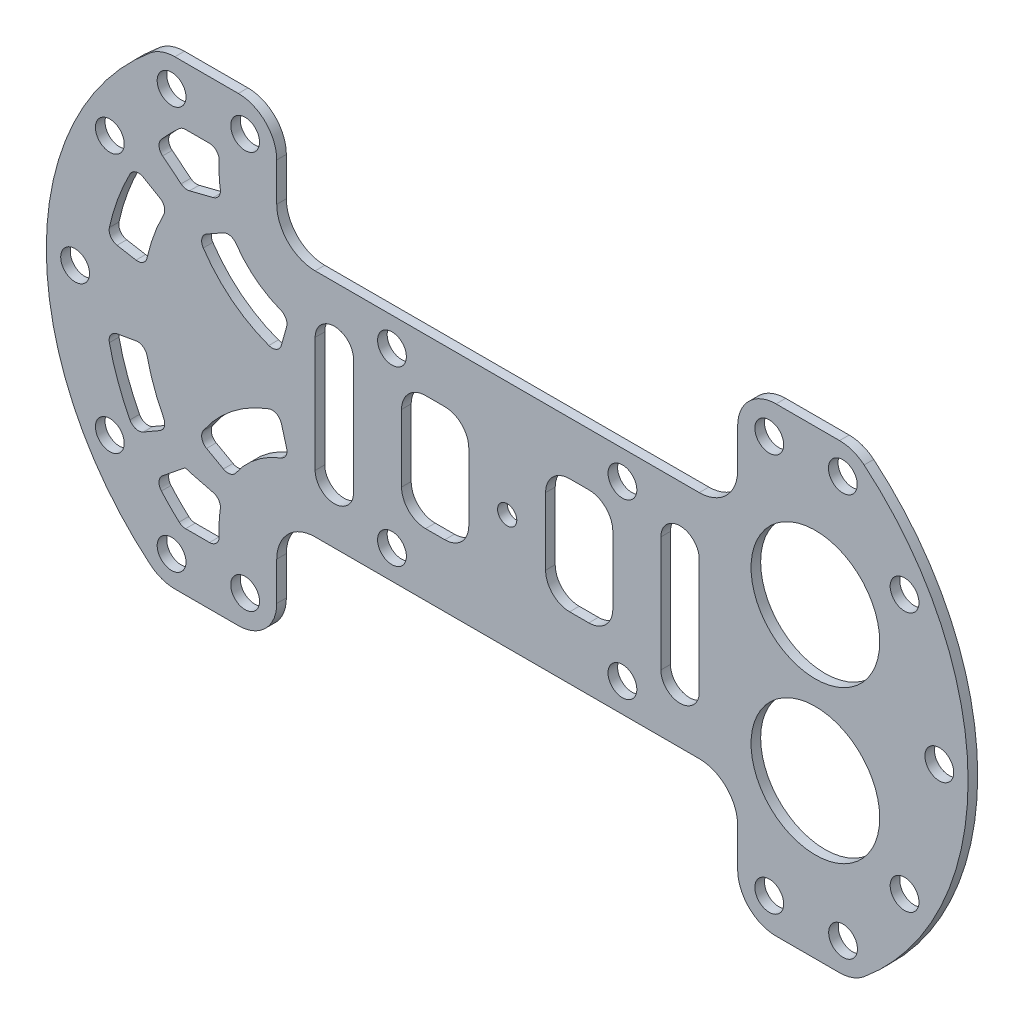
from build123d import *

# Parameters (mm, degrees)
BOSS_EXTRUDE1_DEPTH = 3.175
SKETCH2_R           = 4.7625
CUT_EXTRUDE1_DEPTH  = 12.7
SKETCH3_R           = 21.2725
CUT_EXTRUDE2_DEPTH  = 12.7
SKETCH4_R           = 3.175
CUT_EXTRUDE3_DEPTH  = 256.169224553


with BuildPart() as part:
    # Sketch1 → Boss-Extrude1 (new body)
    with BuildSketch(Plane.XY):
        with BuildLine():
            Line((151.915677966, 88.9), (151.915677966, 101.6))
            ThreePointArc((151.915677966, 101.6), (155.635421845, 110.580256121), (164.615677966, 114.3))
            Line((164.615677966, 114.3), (185.612739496, 114.3))
            ThreePointArc((185.612739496, 114.3), (189.926714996, 113.544857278), (193.727672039, 111.369230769))
            ThreePointArc((193.727672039, 111.369230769), (228.115677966, 38.1), (193.727672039, -35.169230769))
            ThreePointArc((193.727672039, -35.169230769), (189.926714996, -37.344857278), (185.612739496, -38.1))
            Line((185.612739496, -38.1), (164.615677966, -38.1))
            ThreePointArc((164.615677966, -38.1), (155.635421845, -34.380256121), (151.915677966, -25.4))
            Line((151.915677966, -25.4), (151.915677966, -12.7))
            ThreePointArc((151.915677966, -12.7), (148.195934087, -3.719743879), (139.215677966, 0))
            Line((139.215677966, 0), (12.215677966, 0))
            ThreePointArc((12.215677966, 0), (3.235421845, -3.719743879), (-0.484322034, -12.7))
            Line((-0.484322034, -12.7), (-0.484322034, -25.4))
            ThreePointArc((-0.484322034, -25.4), (-4.204065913, -34.380256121), (-13.184322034, -38.1))
            Line((-13.184322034, -38.1), (-34.181383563, -38.1))
            ThreePointArc((-34.181383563, -38.1), (-38.495359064, -37.344857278), (-42.296316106, -35.169230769))
            ThreePointArc((-42.296316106, -35.169230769), (-76.684322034, 38.1), (-42.296316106, 111.369230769))
            ThreePointArc((-42.296316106, 111.369230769), (-38.495359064, 113.544857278), (-34.181383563, 114.3))
            Line((-34.181383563, 114.3), (-13.184322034, 114.3))
            ThreePointArc((-13.184322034, 114.3), (-4.204065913, 110.580256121), (-0.484322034, 101.6))
            Line((-0.484322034, 101.6), (-0.484322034, 88.9))
            ThreePointArc((-0.484322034, 88.9), (3.235421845, 79.919743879), (12.215677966, 76.2))
            Line((12.215677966, 76.2), (139.215677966, 76.2))
            ThreePointArc((139.215677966, 76.2), (148.195934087, 79.919743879), (151.915677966, 88.9))
        make_face()
    extrude(amount=BOSS_EXTRUDE1_DEPTH)

    # Sketch2 → Cut-Extrude1 (cut)
    with BuildSketch(Plane.XY.offset(3.175)):
        with Locations((207.105705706, 80.9625)):
            Circle(SKETCH2_R)
        with Locations((218.590677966, 38.1)):
            Circle(SKETCH2_R)
        with Locations((207.105705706, -4.7625)):
            Circle(SKETCH2_R)
        with Locations((113.815677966, 9.525)):
            Circle(SKETCH2_R)
        with Locations((37.615677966, 9.525)):
            Circle(SKETCH2_R)
        with Locations(Location((37.615677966, 66.675, 0), (0, 0, 180))):
            Circle(SKETCH2_R)
        with Locations(Location((113.815677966, 66.675, 0), (0, 0, 180))):
            Circle(SKETCH2_R)
        with Locations(Location((-55.674349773, 80.9625, 0), (0, 0, 180))):
            Circle(SKETCH2_R)
        with Locations(Location((-67.159322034, 38.1, 0), (0, 0, 180))):
            Circle(SKETCH2_R)
        with Locations(Location((-55.674349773, -4.7625, 0), (0, 0, 180))):
            Circle(SKETCH2_R)
        with Locations((-10.939258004, 103.84506403)):
            Circle(SKETCH2_R)
        with Locations((-35.259877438, 104.586214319)):
            Circle(SKETCH2_R)
        with Locations((-10.939258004, -27.64506403)):
            Circle(SKETCH2_R)
        with Locations((-35.259877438, -28.575)):
            Circle(SKETCH2_R)
        with Locations((162.370613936, -27.64506403)):
            Circle(SKETCH2_R)
        with Locations((186.766328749, -28.358015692)):
            Circle(SKETCH2_R)
        with Locations((162.370613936, 103.84506403)):
            Circle(SKETCH2_R)
        with Locations((186.691233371, 104.586214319)):
            Circle(SKETCH2_R)
    extrude(amount=-CUT_EXTRUDE1_DEPTH, mode=Mode.SUBTRACT)

    # Sketch3 → Cut-Extrude2 (cut)
    with BuildSketch(Plane.XY.offset(3.175)):
        with Locations((177.618359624, 12.895127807)):
            Circle(SKETCH3_R)
        with Locations((177.618359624, 63.304872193)):
            Circle(SKETCH3_R)
        with BuildLine():
            Line((-32.102437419, 78.954923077), (-38.227719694, 83.89388586))
            ThreePointArc((-38.227719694, 83.89388586), (-39.398315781, 86.095739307), (-38.617425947, 88.464001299))
            ThreePointArc((-38.617425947, 88.464001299), (-35.770315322, 91.523214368), (-32.7597709, 94.42173913))
            ThreePointArc((-32.7597709, 94.42173913), (-31.767885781, 95.035702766), (-30.621210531, 95.25))
            Line((-30.621210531, 95.25), (-22.709322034, 95.25))
            ThreePointArc((-22.709322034, 95.25), (-20.464258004, 94.32006403), (-19.534322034, 92.075))
            Line((-19.534322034, 92.075), (-19.534322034, 88.9))
            ThreePointArc((-19.534322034, 88.9), (-19.435704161, 86.399498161), (-19.140463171, 83.914529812))
            ThreePointArc((-19.140463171, 83.914529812), (-19.624152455, 81.670153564), (-21.494538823, 80.338675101))
            Line((-21.494538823, 80.338675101), (-29.32797588, 78.349230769))
            ThreePointArc((-29.32797588, 78.349230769), (-30.786698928, 78.324596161), (-32.102437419, 78.954923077))
        make_face()
        with BuildLine():
            Line((-18.130057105, 71.905549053), (-23.689879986, 68.791894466))
            ThreePointArc((-23.689879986, 68.791894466), (-25.225209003, 66.765285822), (-24.781135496, 64.261852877))
            ThreePointArc((-24.781135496, 64.261852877), (-15.30302816, 53.992646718), (-3.104932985, 47.173732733))
            ThreePointArc((-3.104932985, 47.173732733), (-0.567003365, 47.326346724), (1.045192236, 49.29235871))
            Line((1.045192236, 49.29235871), (2.774894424, 55.425433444))
            ThreePointArc((2.774894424, 55.425433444), (2.556993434, 57.710974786), (0.85515123, 59.252050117))
            ThreePointArc((0.85515123, 59.252050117), (-7.440540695, 63.966176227), (-13.961013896, 70.932159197))
            ThreePointArc((-13.961013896, 70.932159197), (-15.856797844, 72.22722031), (-18.130057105, 71.905549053))
        make_face()
        with BuildLine():
            Line((-39.111061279, 71.399680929), (-44.61602429, 74.577972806))
            ThreePointArc((-44.61602429, 74.577972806), (-47.091766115, 74.876563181), (-49.019576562, 73.294791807))
            ThreePointArc((-49.019576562, 73.294791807), (-53.038899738, 64.161934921), (-55.830406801, 54.582189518))
            ThreePointArc((-55.830406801, 54.582189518), (-55.370361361, 52.131309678), (-53.2819029, 50.768667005))
            Line((-53.2819029, 50.768667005), (-47.021889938, 49.664857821))
            ThreePointArc((-47.021889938, 49.664857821), (-44.711909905, 50.14818046), (-43.373593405, 52.092021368))
            ThreePointArc((-43.373593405, 52.092021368), (-41.104803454, 59.818279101), (-37.876454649, 67.195285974))
            ThreePointArc((-37.876454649, 67.195285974), (-37.652187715, 69.544607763), (-39.111061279, 71.399680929))
        make_face()
        with BuildLine():
            Line((2.774894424, 20.774566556), (1.045192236, 26.90764129))
            ThreePointArc((1.045192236, 26.90764129), (-0.567003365, 28.873653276), (-3.104932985, 29.026267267))
            ThreePointArc((-3.104932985, 29.026267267), (-15.30302816, 22.207353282), (-24.781135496, 11.938147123))
            ThreePointArc((-24.781135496, 11.938147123), (-25.225209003, 9.434714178), (-23.689879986, 7.408105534))
            Line((-23.689879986, 7.408105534), (-18.130057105, 4.294450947))
            ThreePointArc((-18.130057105, 4.294450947), (-15.856797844, 3.97277969), (-13.961013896, 5.267840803))
            ThreePointArc((-13.961013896, 5.267840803), (-7.440540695, 12.233823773), (0.85515123, 16.947949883))
            ThreePointArc((0.85515123, 16.947949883), (2.556993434, 18.489025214), (2.774894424, 20.774566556))
        make_face()
        with BuildLine():
            Line((-22.709322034, -19.05), (-30.621210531, -19.05))
            ThreePointArc((-30.621210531, -19.05), (-31.767885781, -18.835702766), (-32.7597709, -18.22173913))
            ThreePointArc((-32.7597709, -18.22173913), (-35.770315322, -15.323214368), (-38.617425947, -12.264001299))
            ThreePointArc((-38.617425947, -12.264001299), (-39.398315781, -9.895739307), (-38.227719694, -7.69388586))
            Line((-38.227719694, -7.69388586), (-30.866629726, -1.758461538))
            ThreePointArc((-30.866629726, -1.758461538), (-30.072485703, -1.856128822), (-29.32797588, -2.149230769))
            Line((-29.32797588, -2.149230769), (-21.494538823, -4.138675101))
            ThreePointArc((-21.494538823, -4.138675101), (-19.624152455, -5.470153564), (-19.140463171, -7.714529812))
            ThreePointArc((-19.140463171, -7.714529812), (-19.435704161, -10.199498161), (-19.534322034, -12.7))
            Line((-19.534322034, -12.7), (-19.534322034, -15.875))
            ThreePointArc((-19.534322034, -15.875), (-20.464258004, -18.12006403), (-22.709322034, -19.05))
        make_face()
        with BuildLine():
            Line((88.415677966, 50.8), (88.415677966, 28.575))
            ThreePointArc((88.415677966, 28.575), (90.74051789, 22.962339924), (96.353177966, 20.6375))
            Line((96.353177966, 20.6375), (102.703177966, 20.6375))
            ThreePointArc((102.703177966, 20.6375), (108.315838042, 22.962339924), (110.640677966, 28.575))
            Line((110.640677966, 28.575), (110.640677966, 50.8))
            ThreePointArc((110.640677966, 50.8), (108.315838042, 56.412660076), (102.703177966, 58.7375))
            Line((102.703177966, 58.7375), (96.353177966, 58.7375))
            ThreePointArc((96.353177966, 58.7375), (90.74051789, 56.412660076), (88.415677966, 50.8))
        make_face()
        with BuildLine():
            Line((48.728177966, 58.7375), (55.078177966, 58.7375))
            ThreePointArc((55.078177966, 58.7375), (60.690838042, 56.412660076), (63.015677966, 50.8))
            Line((63.015677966, 50.8), (63.015677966, 28.575))
            ThreePointArc((63.015677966, 28.575), (60.690838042, 22.962339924), (55.078177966, 20.6375))
            Line((55.078177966, 20.6375), (48.728177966, 20.6375))
            ThreePointArc((48.728177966, 20.6375), (43.11551789, 22.962339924), (40.790677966, 28.575))
            Line((40.790677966, 28.575), (40.790677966, 50.8))
            ThreePointArc((40.790677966, 50.8), (43.11551789, 56.412660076), (48.728177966, 58.7375))
        make_face()
        with BuildLine():
            Line((-47.021889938, 26.535142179), (-53.2819029, 25.431332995))
            ThreePointArc((-53.2819029, 25.431332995), (-55.370361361, 24.068690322), (-55.830406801, 21.617810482))
            ThreePointArc((-55.830406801, 21.617810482), (-53.038899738, 12.038065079), (-49.019576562, 2.905208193))
            ThreePointArc((-49.019576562, 2.905208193), (-47.091766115, 1.323436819), (-44.61602429, 1.622027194))
            Line((-44.61602429, 1.622027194), (-39.111061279, 4.800319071))
            ThreePointArc((-39.111061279, 4.800319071), (-37.652187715, 6.655392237), (-37.876454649, 9.004714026))
            ThreePointArc((-37.876454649, 9.004714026), (-41.104803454, 16.381720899), (-43.373593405, 24.107978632))
            ThreePointArc((-43.373593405, 24.107978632), (-44.711909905, 26.05181954), (-47.021889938, 26.535142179))
        make_face()
        with BuildLine():
            Line((139.215677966, 57.15), (139.215677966, 19.05))
            ThreePointArc((139.215677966, 19.05), (132.865677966, 12.7), (126.515677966, 19.05))
            Line((126.515677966, 19.05), (126.515677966, 57.15))
            ThreePointArc((126.515677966, 57.15), (132.865677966, 63.5), (139.215677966, 57.15))
        make_face()
        with BuildLine():
            Line((24.915677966, 57.15), (24.915677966, 19.05))
            ThreePointArc((24.915677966, 19.05), (18.565677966, 12.7), (12.215677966, 19.05))
            Line((12.215677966, 19.05), (12.215677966, 57.15))
            ThreePointArc((12.215677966, 57.15), (18.565677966, 63.5), (24.915677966, 57.15))
        make_face()
    extrude(amount=-CUT_EXTRUDE2_DEPTH, mode=Mode.SUBTRACT)

    # Sketch4 → Cut-Extrude3 (cut, through all)
    with BuildSketch(Plane.XY.offset(3.175)):
        with Locations((75.715677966, 38.1)):
            Circle(SKETCH4_R)
    extrude(amount=-CUT_EXTRUDE3_DEPTH, mode=Mode.SUBTRACT)


solid = part.part
